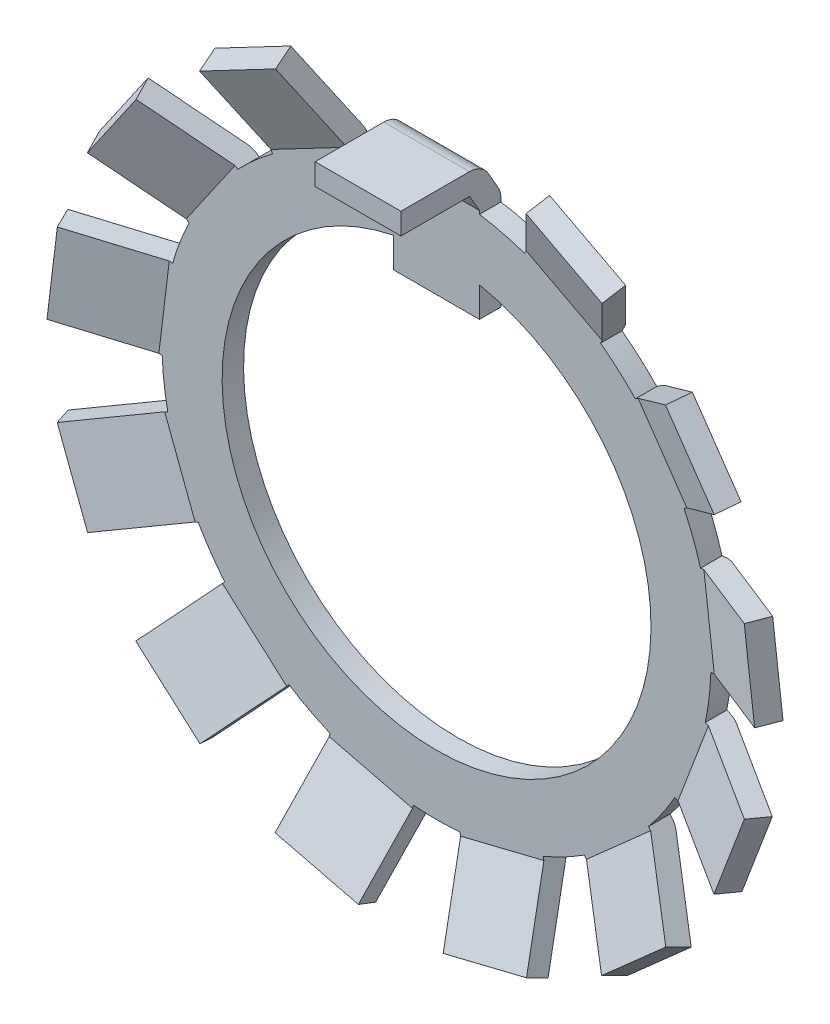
from build123d import *

# Parameters (mm, degrees)
ESQUISSE1_R                  = 16
BASE_EXTRUSION_DEPTH         = 1.25
BOSS_EXTRU_MINCE1_DEPTH      = 2.5
R_P_TITION_CIRCULAIRE1_COUNT = 12
R_P_TITION_CIRCULAIRE1_ANGLE = 304.615384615
BOSS_EXTRU_MINCE2_DEPTH      = 2.5


with BuildPart() as part:
    # Esquisse1 → Base-Extrusion (new body)
    with BuildSketch(Plane.XY):
        Circle(ESQUISSE1_R)
        with BuildLine():
            Line((-2.5, 10.5), (2.5, 10.5))
            Line((2.5, 10.5), (2.5, 12.247448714))
            ThreePointArc((2.5, 12.247448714), (0, -12.5), (-2.5, 12.247448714))
            Line((-2.5, 12.247448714), (-2.5, 10.5))
        make_face(mode=Mode.SUBTRACT)
    extrude(amount=BASE_EXTRUSION_DEPTH)

    # Esquisse2 → Boss.-Extru.-Mince1 (add, symmetric)
    with BuildSketch(Plane(origin=(0, 0, 0), x_dir=(-0.46472317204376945, 0.8854560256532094, 0), z_dir=(0.8854560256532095, 0.4647231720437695, 0))):
        with BuildLine():
            Line((12.5, 0), (16, 0))
            ThreePointArc((16, 0), (16.270549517, 0.029629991), (16.528272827, 0.117115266))
            Line((16.528272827, 0.117115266), (21, 2.202315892))
            Line((21, 2.202315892), (20.471727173, 3.335200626))
            Line((20.471727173, 3.335200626), (16, 1.25))
            Line((16, 1.25), (12.5, 1.25))
            Line((12.5, 1.25), (12.5, 0))
        make_face()
    boss_extru_mince1 = extrude(amount=BOSS_EXTRU_MINCE1_DEPTH, both=True)

    # R_p_tition circulaire1: Boss.-Extru.-Mince1 ×12 about axis
    r_p_tition_circulaire1_axis = Axis((0, 0, -7.805907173), (0, 0, 1))
    for i in range(1, R_P_TITION_CIRCULAIRE1_COUNT):
        add(boss_extru_mince1.rotate(r_p_tition_circulaire1_axis, i * R_P_TITION_CIRCULAIRE1_ANGLE / (R_P_TITION_CIRCULAIRE1_COUNT - 1)))

    # Esquisse3 → Boss.-Extru.-Mince2 (add, symmetric)
    with BuildSketch(Plane(origin=(0, 0, 0), x_dir=(0, 0, -1), z_dir=(1, 0, 0))):
        with BuildLine():
            Line((0, 12.5), (0, 16))
            ThreePointArc((0, 16), (-0.042592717, 16.323523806), (-0.167468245, 16.625))
            Line((-0.167468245, 16.625), (-0.744818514, 17.625))
            ThreePointArc((-0.744818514, 17.625), (-1.202350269, 18.082531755), (-1.827350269, 18.25))
            Line((-1.827350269, 18.25), (-5.827350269, 18.25))
            Line((-5.827350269, 18.25), (-5.827350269, 17))
            Line((-5.827350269, 17), (-1.827350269, 17))
            Line((-1.827350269, 17), (-1.25, 16))
            Line((-1.25, 16), (-1.25, 12.5))
            Line((-1.25, 12.5), (0, 12.5))
        make_face()
    extrude(amount=BOSS_EXTRU_MINCE2_DEPTH, both=True)


solid = part.part
